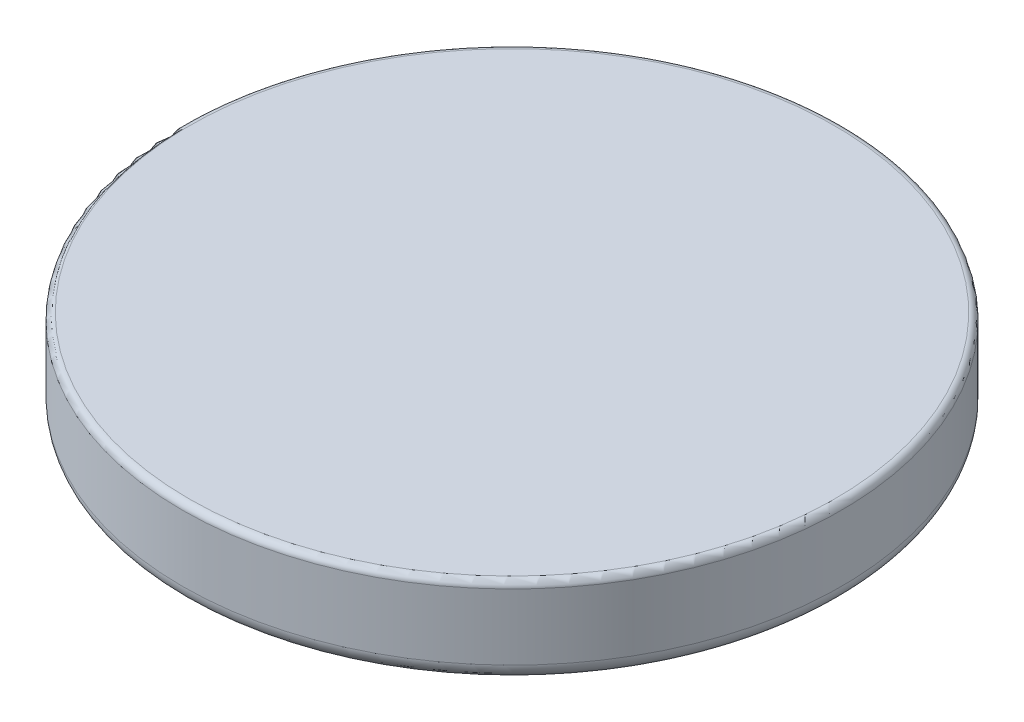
from build123d import *

# Parameters (mm, degrees)
ESQUISSE1_R             = 10
BOSS_EXTRU_1_DEPTH      = 3.1
ESQUISSE2_R             = 10.135184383
ESQUISSE2_R_2           = 9
ENL_V_MAT_EXTRU_1_DEPTH = 0.4
CONG_1_R                = 0.2
CONG_2_R                = 0.5


with BuildPart() as part:
    # Esquisse1 → Boss.-Extru.1 (new body)
    with BuildSketch(Plane(origin=(0, 0, 0), x_dir=(1, 0, 0), z_dir=(0, 1, 0))):
        with Locations(Location((0, 0, 0), (0, 0, 90))):
            Circle(ESQUISSE1_R)
    extrude(amount=BOSS_EXTRU_1_DEPTH)

    # Esquisse2 → Enl_v. mat.-Extru.1 (cut)
    with BuildSketch(Plane.XZ):
        Circle(ESQUISSE2_R)
        with Locations(Location((0, 0, 0), (0, 0, 270))):
            Circle(ESQUISSE2_R_2, mode=Mode.SUBTRACT)
    extrude(amount=-ENL_V_MAT_EXTRU_1_DEPTH, mode=Mode.SUBTRACT)

    # Cong_1
    cong_1_edges = [part.edges().sort_by_distance(p)[0] for p in [
        (0, 3.1, 10),
        (0, 0, 9),
    ]]
    fillet(cong_1_edges, radius=CONG_1_R)

    # Cong_2
    cong_2_edges = [part.edges().sort_by_distance(p)[0] for p in [
        (0, 0.4, 10),
    ]]
    fillet(cong_2_edges, radius=CONG_2_R)


solid = part.part
